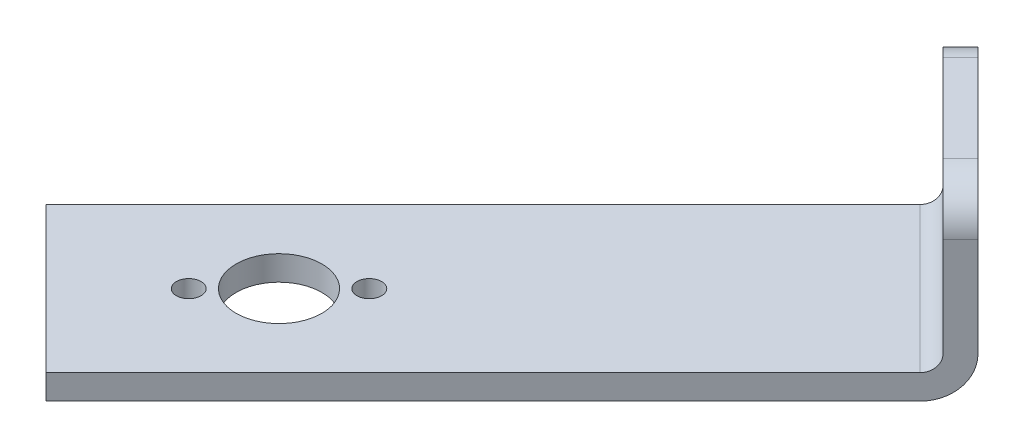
ISO-10303-21;
HEADER;
FILE_DESCRIPTION(('STEP AP214'),'2;1');
FILE_NAME('part.step','',(''),(''),'','','');
FILE_SCHEMA(('AUTOMOTIVE_DESIGN { 1 0 10303 214 1 1 1 1 }'));
ENDSEC;
DATA;
#1=APPLICATION_CONTEXT('core data for automotive mechanical design processes');
#2=APPLICATION_PROTOCOL_DEFINITION('international standard','automotive_design',2000,#1);
#3=PRODUCT_CONTEXT('',#1,'mechanical');
#4=PRODUCT('Part','Part','',(#3));
#5=PRODUCT_RELATED_PRODUCT_CATEGORY('part','',(#4));
#6=PRODUCT_DEFINITION_FORMATION('','',#4);
#7=PRODUCT_DEFINITION_CONTEXT('part definition',#1,'design');
#8=PRODUCT_DEFINITION('design','',#6,#7);
#9=PRODUCT_DEFINITION_SHAPE('','',#8);
#10=(LENGTH_UNIT() NAMED_UNIT(*) SI_UNIT(.MILLI.,.METRE.));
#11=(NAMED_UNIT(*) PLANE_ANGLE_UNIT() SI_UNIT($,.RADIAN.));
#12=(NAMED_UNIT(*) SI_UNIT($,.STERADIAN.) SOLID_ANGLE_UNIT());
#13=UNCERTAINTY_MEASURE_WITH_UNIT(LENGTH_MEASURE(1.E-05),#10,'distance_accuracy_value','');
#14=(GEOMETRIC_REPRESENTATION_CONTEXT(3) GLOBAL_UNCERTAINTY_ASSIGNED_CONTEXT((#13)) GLOBAL_UNIT_ASSIGNED_CONTEXT((#10,
#11,#12)) REPRESENTATION_CONTEXT('',''));
#15=CARTESIAN_POINT('',(0.,0.,0.));
#16=DIRECTION('',(0.,0.,1.));
#17=DIRECTION('',(1.,0.,0.));
#18=AXIS2_PLACEMENT_3D('',#15,#16,#17);
#19=CARTESIAN_POINT('',(42.4264068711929,-2.0931839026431E-13,-42.4264068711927));
#20=DIRECTION('',(-0.707106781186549,0.,0.707106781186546));
#21=DIRECTION('',(0.707106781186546,0.,0.707106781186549));
#22=AXIS2_PLACEMENT_3D('',#19,#20,#21);
#23=PLANE('',#22);
#24=CARTESIAN_POINT('',(47.729707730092,25.,-37.1231060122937));
#25=DIRECTION('',(-0.707106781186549,0.,0.707106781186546));
#26=DIRECTION('',(0.707106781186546,0.,0.707106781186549));
#27=AXIS2_PLACEMENT_3D('',#24,#25,#26);
#28=CIRCLE('',#27,5.);
#29=CARTESIAN_POINT('',(51.2652416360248,25.,-33.5875721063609));
#30=VERTEX_POINT('',#29);
#31=CARTESIAN_POINT('',(47.7297077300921,30.,-37.1231060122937));
#32=VERTEX_POINT('',#31);
#33=EDGE_CURVE('E93',#30,#32,#28,.T.);
#34=ORIENTED_EDGE('',*,*,#33,.F.);
#35=DIRECTION('',(0.,1.,0.));
#36=VECTOR('',#35,1.);
#37=CARTESIAN_POINT('',(51.2652416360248,11.,-33.5875721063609));
#38=LINE('',#37,#36);
#39=CARTESIAN_POINT('',(51.2652416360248,13.,-33.5875721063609));
#40=VERTEX_POINT('',#39);
#41=EDGE_CURVE('E97',#30,#40,#38,.F.);
#42=ORIENTED_EDGE('',*,*,#41,.T.);
#43=DIRECTION('',(-0.707106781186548,0.,-0.707106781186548));
#44=VECTOR('',#43,1.);
#45=CARTESIAN_POINT('',(33.5875721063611,13.,-51.2652416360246));
#46=LINE('',#45,#44);
#47=CARTESIAN_POINT('',(33.5875721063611,13.,-51.2652416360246));
#48=VERTEX_POINT('',#47);
#49=EDGE_CURVE('E165',#48,#40,#46,.F.);
#50=ORIENTED_EDGE('',*,*,#49,.F.);
#51=DIRECTION('',(0.,1.,0.));
#52=VECTOR('',#51,1.);
#53=CARTESIAN_POINT('',(33.587572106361,30.,-51.2652416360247));
#54=LINE('',#53,#52);
#55=CARTESIAN_POINT('',(33.5875721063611,25.,-51.2652416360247));
#56=VERTEX_POINT('',#55);
#57=EDGE_CURVE('E113',#48,#56,#54,.T.);
#58=ORIENTED_EDGE('',*,*,#57,.T.);
#59=CARTESIAN_POINT('',(37.1231060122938,25.,-47.729707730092));
#60=DIRECTION('',(-0.707106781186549,0.,0.707106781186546));
#61=DIRECTION('',(0.707106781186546,0.,0.707106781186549));
#62=AXIS2_PLACEMENT_3D('',#59,#60,#61);
#63=CIRCLE('',#62,5.);
#64=CARTESIAN_POINT('',(37.1231060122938,30.,-47.729707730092));
#65=VERTEX_POINT('',#64);
#66=EDGE_CURVE('E121',#65,#56,#63,.T.);
#67=ORIENTED_EDGE('',*,*,#66,.F.);
#68=DIRECTION('',(0.707106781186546,0.,0.707106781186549));
#69=VECTOR('',#68,1.);
#70=CARTESIAN_POINT('',(37.1231060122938,30.,-47.729707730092));
#71=LINE('',#70,#69);
#72=EDGE_CURVE('E100',#65,#32,#71,.T.);
#73=ORIENTED_EDGE('',*,*,#72,.T.);
#74=EDGE_LOOP('',(#34,#42,#50,#58,#67,#73));
#75=FACE_BOUND('',#74,.T.);
#76=CARTESIAN_POINT('',(42.426406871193,24.,-42.4264068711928));
#77=DIRECTION('',(0.707106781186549,0.,-0.707106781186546));
#78=DIRECTION('',(-0.707106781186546,0.,-0.707106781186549));
#79=AXIS2_PLACEMENT_3D('',#76,#77,#78);
#80=CIRCLE('',#79,3.5);
#81=CARTESIAN_POINT('',(39.9515331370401,24.,-44.9012806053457));
#82=VERTEX_POINT('',#81);
#83=EDGE_CURVE('E20',#82,#82,#80,.F.);
#84=ORIENTED_EDGE('',*,*,#83,.T.);
#85=EDGE_LOOP('',(#84));
#86=FACE_BOUND('',#85,.T.);
#87=ADVANCED_FACE('F17',(#75,#86),#23,.F.);
#88=CARTESIAN_POINT('',(36.7695526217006,24.0000000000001,-36.7695526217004));
#89=DIRECTION('',(0.707106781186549,0.,-0.707106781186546));
#90=DIRECTION('',(-0.707106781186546,0.,-0.707106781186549));
#91=AXIS2_PLACEMENT_3D('',#88,#89,#90);
#92=CYLINDRICAL_SURFACE('',#91,3.5);
#93=CARTESIAN_POINT('',(40.3050865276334,24.,-40.3050865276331));
#94=DIRECTION('',(0.707106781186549,0.,-0.707106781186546));
#95=DIRECTION('',(-0.707106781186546,0.,-0.707106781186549));
#96=AXIS2_PLACEMENT_3D('',#93,#94,#95);
#97=CIRCLE('',#96,3.5);
#98=CARTESIAN_POINT('',(37.8302127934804,24.,-42.779960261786));
#99=VERTEX_POINT('',#98);
#100=EDGE_CURVE('E162',#99,#99,#97,.T.);
#101=ORIENTED_EDGE('',*,*,#100,.F.);
#102=EDGE_LOOP('',(#101));
#103=FACE_BOUND('',#102,.T.);
#104=ORIENTED_EDGE('',*,*,#83,.F.);
#105=EDGE_LOOP('',(#104));
#106=FACE_BOUND('',#105,.T.);
#107=ADVANCED_FACE('F283',(#103,#106),#92,.F.);
#108=CARTESIAN_POINT('',(47.729707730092,25.,-37.1231060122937));
#109=DIRECTION('',(-0.707106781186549,0.,0.707106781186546));
#110=DIRECTION('',(0.707106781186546,0.,0.707106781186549));
#111=AXIS2_PLACEMENT_3D('',#108,#109,#110);
#112=CYLINDRICAL_SURFACE('',#111,5.);
#113=CARTESIAN_POINT('',(45.6083873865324,25.,-35.0017856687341));
#114=DIRECTION('',(-0.707106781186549,0.,0.707106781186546));
#115=DIRECTION('',(0.707106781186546,0.,0.707106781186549));
#116=AXIS2_PLACEMENT_3D('',#113,#114,#115);
#117=CIRCLE('',#116,5.);
#118=CARTESIAN_POINT('',(49.1439212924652,25.,-31.4662517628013));
#119=VERTEX_POINT('',#118);
#120=CARTESIAN_POINT('',(45.6083873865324,30.,-35.0017856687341));
#121=VERTEX_POINT('',#120);
#122=EDGE_CURVE('E117',#119,#121,#117,.T.);
#123=ORIENTED_EDGE('',*,*,#122,.F.);
#124=DIRECTION('',(-0.707106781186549,0.,0.707106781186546));
#125=VECTOR('',#124,1.);
#126=CARTESIAN_POINT('',(51.2652416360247,25.,-33.5875721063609));
#127=LINE('',#126,#125);
#128=EDGE_CURVE('E108',#119,#30,#127,.F.);
#129=ORIENTED_EDGE('',*,*,#128,.T.);
#130=ORIENTED_EDGE('',*,*,#33,.T.);
#131=DIRECTION('',(-0.707106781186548,0.,0.707106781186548));
#132=VECTOR('',#131,1.);
#133=CARTESIAN_POINT('',(47.7297077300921,30.,-37.1231060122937));
#134=LINE('',#133,#132);
#135=EDGE_CURVE('E125',#32,#121,#134,.T.);
#136=ORIENTED_EDGE('',*,*,#135,.T.);
#137=EDGE_LOOP('',(#123,#129,#130,#136));
#138=FACE_BOUND('',#137,.T.);
#139=ADVANCED_FACE('F116',(#138),#112,.T.);
#140=CARTESIAN_POINT('',(51.2652416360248,30.,-33.587572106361));
#141=DIRECTION('',(0.,-1.,0.));
#142=DIRECTION('',(1.,0.,0.));
#143=AXIS2_PLACEMENT_3D('',#140,#141,#142);
#144=PLANE('',#143);
#145=ORIENTED_EDGE('',*,*,#135,.F.);
#146=ORIENTED_EDGE('',*,*,#72,.F.);
#147=DIRECTION('',(-0.707106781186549,0.,0.707106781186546));
#148=VECTOR('',#147,1.);
#149=CARTESIAN_POINT('',(37.1231060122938,30.,-47.729707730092));
#150=LINE('',#149,#148);
#151=CARTESIAN_POINT('',(35.0017856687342,30.,-45.6083873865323));
#152=VERTEX_POINT('',#151);
#153=EDGE_CURVE('E118',#152,#65,#150,.F.);
#154=ORIENTED_EDGE('',*,*,#153,.F.);
#155=DIRECTION('',(0.707106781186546,0.,0.707106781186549));
#156=VECTOR('',#155,1.);
#157=CARTESIAN_POINT('',(40.3050865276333,30.,-40.3050865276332));
#158=LINE('',#157,#156);
#159=EDGE_CURVE('E159',#121,#152,#158,.F.);
#160=ORIENTED_EDGE('',*,*,#159,.F.);
#161=EDGE_LOOP('',(#145,#146,#154,#160));
#162=FACE_BOUND('',#161,.T.);
#163=ADVANCED_FACE('F172',(#162),#144,.F.);
#164=CARTESIAN_POINT('',(37.1231060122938,25.,-47.729707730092));
#165=DIRECTION('',(-0.707106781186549,0.,0.707106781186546));
#166=DIRECTION('',(0.707106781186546,0.,0.707106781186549));
#167=AXIS2_PLACEMENT_3D('',#164,#165,#166);
#168=CYLINDRICAL_SURFACE('',#167,5.);
#169=CARTESIAN_POINT('',(35.0017856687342,25.,-45.6083873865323));
#170=DIRECTION('',(-0.707106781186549,0.,0.707106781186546));
#171=DIRECTION('',(0.707106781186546,0.,0.707106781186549));
#172=AXIS2_PLACEMENT_3D('',#169,#170,#171);
#173=CIRCLE('',#172,5.);
#174=CARTESIAN_POINT('',(31.4662517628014,25.,-49.1439212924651));
#175=VERTEX_POINT('',#174);
#176=EDGE_CURVE('E157',#152,#175,#173,.T.);
#177=ORIENTED_EDGE('',*,*,#176,.F.);
#178=ORIENTED_EDGE('',*,*,#153,.T.);
#179=ORIENTED_EDGE('',*,*,#66,.T.);
#180=DIRECTION('',(0.707106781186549,0.,-0.707106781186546));
#181=VECTOR('',#180,1.);
#182=CARTESIAN_POINT('',(33.5875721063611,25.,-51.2652416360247));
#183=LINE('',#182,#181);
#184=EDGE_CURVE('E182',#56,#175,#183,.F.);
#185=ORIENTED_EDGE('',*,*,#184,.T.);
#186=EDGE_LOOP('',(#177,#178,#179,#185));
#187=FACE_BOUND('',#186,.T.);
#188=ADVANCED_FACE('F185',(#187),#168,.T.);
#189=CARTESIAN_POINT('',(30.0520382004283,13.,-47.7297077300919));
#190=DIRECTION('',(-0.707106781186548,0.,-0.707106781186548));
#191=DIRECTION('',(-0.707106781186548,0.,0.707106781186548));
#192=AXIS2_PLACEMENT_3D('',#189,#190,#191);
#193=CYLINDRICAL_SURFACE('',#192,4.99999999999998);
#194=ORIENTED_EDGE('',*,*,#49,.T.);
#195=CARTESIAN_POINT('',(47.7297077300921,13.,-30.0520382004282));
#196=DIRECTION('',(-0.707106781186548,0.,-0.707106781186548));
#197=DIRECTION('',(-0.707106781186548,0.,0.707106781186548));
#198=AXIS2_PLACEMENT_3D('',#195,#196,#197);
#199=CIRCLE('',#198,4.99999999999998);
#200=CARTESIAN_POINT('',(47.7297077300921,8.,-30.0520382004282));
#201=VERTEX_POINT('',#200);
#202=EDGE_CURVE('E112',#201,#40,#199,.F.);
#203=ORIENTED_EDGE('',*,*,#202,.F.);
#204=DIRECTION('',(0.707106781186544,0.,0.707106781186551));
#205=VECTOR('',#204,1.);
#206=CARTESIAN_POINT('',(30.0520382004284,8.,-47.729707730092));
#207=LINE('',#206,#205);
#208=CARTESIAN_POINT('',(30.0520382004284,8.00000000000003,-47.7297077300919));
#209=VERTEX_POINT('',#208);
#210=EDGE_CURVE('E151',#209,#201,#207,.T.);
#211=ORIENTED_EDGE('',*,*,#210,.F.);
#212=CARTESIAN_POINT('',(30.0520382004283,13.,-47.7297077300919));
#213=DIRECTION('',(-0.707106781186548,0.,-0.707106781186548));
#214=DIRECTION('',(-0.707106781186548,0.,0.707106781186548));
#215=AXIS2_PLACEMENT_3D('',#212,#213,#214);
#216=CIRCLE('',#215,4.99999999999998);
#217=EDGE_CURVE('E152',#209,#48,#216,.F.);
#218=ORIENTED_EDGE('',*,*,#217,.T.);
#219=EDGE_LOOP('',(#194,#203,#211,#218));
#220=FACE_BOUND('',#219,.T.);
#221=ADVANCED_FACE('F274',(#220),#193,.T.);
#222=CARTESIAN_POINT('',(40.3050865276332,-1.9884394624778E-13,-40.3050865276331));
#223=DIRECTION('',(-0.707106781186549,0.,0.707106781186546));
#224=DIRECTION('',(0.707106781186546,0.,0.707106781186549));
#225=AXIS2_PLACEMENT_3D('',#222,#223,#224);
#226=PLANE('',#225);
#227=DIRECTION('',(0.,1.,0.));
#228=VECTOR('',#227,1.);
#229=CARTESIAN_POINT('',(31.4662517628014,-1.9884394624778E-13,-49.143921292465));
#230=LINE('',#229,#228);
#231=CARTESIAN_POINT('',(31.4662517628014,13.,-49.143921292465));
#232=VERTEX_POINT('',#231);
#233=EDGE_CURVE('E156',#175,#232,#230,.F.);
#234=ORIENTED_EDGE('',*,*,#233,.T.);
#235=DIRECTION('',(-0.707106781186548,0.,-0.707106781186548));
#236=VECTOR('',#235,1.);
#237=CARTESIAN_POINT('',(31.4662517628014,13.,-49.143921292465));
#238=LINE('',#237,#236);
#239=CARTESIAN_POINT('',(49.1439212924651,13.,-31.4662517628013));
#240=VERTEX_POINT('',#239);
#241=EDGE_CURVE('E147',#232,#240,#238,.F.);
#242=ORIENTED_EDGE('',*,*,#241,.T.);
#243=DIRECTION('',(0.,1.,0.));
#244=VECTOR('',#243,1.);
#245=CARTESIAN_POINT('',(49.1439212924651,-1.9884394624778E-13,-31.4662517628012));
#246=LINE('',#245,#244);
#247=EDGE_CURVE('E161',#240,#119,#246,.T.);
#248=ORIENTED_EDGE('',*,*,#247,.T.);
#249=ORIENTED_EDGE('',*,*,#122,.T.);
#250=ORIENTED_EDGE('',*,*,#159,.T.);
#251=ORIENTED_EDGE('',*,*,#176,.T.);
#252=EDGE_LOOP('',(#234,#242,#248,#249,#250,#251));
#253=FACE_BOUND('',#252,.T.);
#254=ORIENTED_EDGE('',*,*,#100,.T.);
#255=EDGE_LOOP('',(#254));
#256=FACE_BOUND('',#255,.T.);
#257=ADVANCED_FACE('F189',(#253,#256),#226,.T.);
#258=CARTESIAN_POINT('',(0.,8.,0.));
#259=DIRECTION('',(0.,-1.,0.));
#260=DIRECTION('',(0.,0.,-1.));
#261=AXIS2_PLACEMENT_3D('',#258,#259,#260);
#262=PLANE('',#261);
#263=CARTESIAN_POINT('',(-5.48007755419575,8.,5.48007755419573));
#264=DIRECTION('',(0.,1.,0.));
#265=DIRECTION('',(0.,0.,1.));
#266=AXIS2_PLACEMENT_3D('',#263,#264,#265);
#267=CIRCLE('',#266,1.5);
#268=CARTESIAN_POINT('',(-5.48007755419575,8.,6.98007755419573));
#269=VERTEX_POINT('',#268);
#270=EDGE_CURVE('E133',#269,#269,#267,.T.);
#271=ORIENTED_EDGE('',*,*,#270,.T.);
#272=EDGE_LOOP('',(#271));
#273=FACE_BOUND('',#272,.T.);
#274=CARTESIAN_POINT('',(5.48007755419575,8.,-5.48007755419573));
#275=DIRECTION('',(0.,1.,0.));
#276=DIRECTION('',(0.,0.,1.));
#277=AXIS2_PLACEMENT_3D('',#274,#275,#276);
#278=CIRCLE('',#277,1.5);
#279=CARTESIAN_POINT('',(5.48007755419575,8.,-3.98007755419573));
#280=VERTEX_POINT('',#279);
#281=EDGE_CURVE('E140',#280,#280,#278,.T.);
#282=ORIENTED_EDGE('',*,*,#281,.T.);
#283=EDGE_LOOP('',(#282));
#284=FACE_BOUND('',#283,.T.);
#285=DIRECTION('',(-0.707106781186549,0.,0.707106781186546));
#286=VECTOR('',#285,1.);
#287=CARTESIAN_POINT('',(-5.30330085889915,8.,22.9809703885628));
#288=LINE('',#287,#286);
#289=CARTESIAN_POINT('',(-5.30330085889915,8.,22.9809703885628));
#290=VERTEX_POINT('',#289);
#291=EDGE_CURVE('E146',#201,#290,#288,.T.);
#292=ORIENTED_EDGE('',*,*,#291,.T.);
#293=DIRECTION('',(-0.707106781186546,0.,-0.707106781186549));
#294=VECTOR('',#293,1.);
#295=CARTESIAN_POINT('',(-22.9809703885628,8.,5.30330085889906));
#296=LINE('',#295,#294);
#297=CARTESIAN_POINT('',(-22.9809703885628,8.,5.30330085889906));
#298=VERTEX_POINT('',#297);
#299=EDGE_CURVE('E210',#290,#298,#296,.T.);
#300=ORIENTED_EDGE('',*,*,#299,.T.);
#301=DIRECTION('',(0.707106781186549,0.,-0.707106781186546));
#302=VECTOR('',#301,1.);
#303=CARTESIAN_POINT('',(-22.9809703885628,8.,5.30330085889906));
#304=LINE('',#303,#302);
#305=EDGE_CURVE('E143',#298,#209,#304,.T.);
#306=ORIENTED_EDGE('',*,*,#305,.T.);
#307=ORIENTED_EDGE('',*,*,#210,.T.);
#308=EDGE_LOOP('',(#292,#300,#306,#307));
#309=FACE_BOUND('',#308,.T.);
#310=CARTESIAN_POINT('',(0.,8.,0.));
#311=DIRECTION('',(0.,1.,0.));
#312=DIRECTION('',(0.,0.,1.));
#313=AXIS2_PLACEMENT_3D('',#310,#311,#312);
#314=CIRCLE('',#313,5.2);
#315=CARTESIAN_POINT('',(0.,8.,5.2));
#316=VERTEX_POINT('',#315);
#317=EDGE_CURVE('E137',#316,#316,#314,.T.);
#318=ORIENTED_EDGE('',*,*,#317,.T.);
#319=EDGE_LOOP('',(#318));
#320=FACE_BOUND('',#319,.T.);
#321=ADVANCED_FACE('F230',(#273,#284,#309,#320),#262,.T.);
#322=CARTESIAN_POINT('',(30.0520382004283,13.,-47.7297077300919));
#323=DIRECTION('',(-0.707106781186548,0.,-0.707106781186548));
#324=DIRECTION('',(-0.707106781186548,0.,0.707106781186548));
#325=AXIS2_PLACEMENT_3D('',#322,#323,#324);
#326=CYLINDRICAL_SURFACE('',#325,1.99999999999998);
#327=CARTESIAN_POINT('',(47.7297077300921,13.,-30.0520382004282));
#328=DIRECTION('',(-0.707106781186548,0.,-0.707106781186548));
#329=DIRECTION('',(-0.707106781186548,0.,0.707106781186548));
#330=AXIS2_PLACEMENT_3D('',#327,#328,#329);
#331=CIRCLE('',#330,1.99999999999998);
#332=CARTESIAN_POINT('',(47.7297077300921,11.,-30.0520382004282));
#333=VERTEX_POINT('',#332);
#334=EDGE_CURVE('E144',#240,#333,#331,.T.);
#335=ORIENTED_EDGE('',*,*,#334,.F.);
#336=ORIENTED_EDGE('',*,*,#241,.F.);
#337=CARTESIAN_POINT('',(30.0520382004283,13.,-47.7297077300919));
#338=DIRECTION('',(-0.707106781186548,0.,-0.707106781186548));
#339=DIRECTION('',(-0.707106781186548,0.,0.707106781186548));
#340=AXIS2_PLACEMENT_3D('',#337,#338,#339);
#341=CIRCLE('',#340,1.99999999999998);
#342=CARTESIAN_POINT('',(30.0520382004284,11.,-47.7297077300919));
#343=VERTEX_POINT('',#342);
#344=EDGE_CURVE('E148',#343,#232,#341,.F.);
#345=ORIENTED_EDGE('',*,*,#344,.F.);
#346=DIRECTION('',(0.707106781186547,0.,0.707106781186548));
#347=VECTOR('',#346,1.);
#348=CARTESIAN_POINT('',(30.0520382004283,11.,-47.7297077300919));
#349=LINE('',#348,#347);
#350=EDGE_CURVE('E136',#343,#333,#349,.T.);
#351=ORIENTED_EDGE('',*,*,#350,.T.);
#352=EDGE_LOOP('',(#335,#336,#345,#351));
#353=FACE_BOUND('',#352,.T.);
#354=ADVANCED_FACE('F193',(#353),#326,.F.);
#355=CARTESIAN_POINT('',(-5.30330085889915,8.,22.9809703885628));
#356=DIRECTION('',(-0.707106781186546,0.,-0.707106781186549));
#357=DIRECTION('',(-0.707106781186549,0.,0.707106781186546));
#358=AXIS2_PLACEMENT_3D('',#355,#356,#357);
#359=PLANE('',#358);
#360=DIRECTION('',(0.,1.,0.));
#361=VECTOR('',#360,1.);
#362=CARTESIAN_POINT('',(-5.30330085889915,8.,22.9809703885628));
#363=LINE('',#362,#361);
#364=CARTESIAN_POINT('',(-5.30330085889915,11.,22.9809703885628));
#365=VERTEX_POINT('',#364);
#366=EDGE_CURVE('E206',#365,#290,#363,.F.);
#367=ORIENTED_EDGE('',*,*,#366,.T.);
#368=ORIENTED_EDGE('',*,*,#291,.F.);
#369=ORIENTED_EDGE('',*,*,#202,.T.);
#370=ORIENTED_EDGE('',*,*,#41,.F.);
#371=ORIENTED_EDGE('',*,*,#128,.F.);
#372=ORIENTED_EDGE('',*,*,#247,.F.);
#373=ORIENTED_EDGE('',*,*,#334,.T.);
#374=DIRECTION('',(-0.707106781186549,0.,0.707106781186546));
#375=VECTOR('',#374,1.);
#376=CARTESIAN_POINT('',(47.7297077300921,11.,-30.0520382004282));
#377=LINE('',#376,#375);
#378=EDGE_CURVE('E199',#333,#365,#377,.T.);
#379=ORIENTED_EDGE('',*,*,#378,.T.);
#380=EDGE_LOOP('',(#367,#368,#369,#370,#371,#372,#373,#379));
#381=FACE_BOUND('',#380,.T.);
#382=ADVANCED_FACE('F107',(#381),#359,.F.);
#383=CARTESIAN_POINT('',(-22.9809703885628,8.,5.30330085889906));
#384=DIRECTION('',(0.707106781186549,0.,-0.707106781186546));
#385=DIRECTION('',(-0.707106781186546,0.,-0.707106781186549));
#386=AXIS2_PLACEMENT_3D('',#383,#384,#385);
#387=PLANE('',#386);
#388=DIRECTION('',(0.,1.,0.));
#389=VECTOR('',#388,1.);
#390=CARTESIAN_POINT('',(-22.9809703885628,8.,5.30330085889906));
#391=LINE('',#390,#389);
#392=CARTESIAN_POINT('',(-22.9809703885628,11.,5.30330085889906));
#393=VERTEX_POINT('',#392);
#394=EDGE_CURVE('E35',#393,#298,#391,.F.);
#395=ORIENTED_EDGE('',*,*,#394,.T.);
#396=ORIENTED_EDGE('',*,*,#299,.F.);
#397=ORIENTED_EDGE('',*,*,#366,.F.);
#398=DIRECTION('',(-0.707106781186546,0.,-0.707106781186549));
#399=VECTOR('',#398,1.);
#400=CARTESIAN_POINT('',(-5.30330085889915,11.,22.9809703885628));
#401=LINE('',#400,#399);
#402=EDGE_CURVE('E202',#365,#393,#401,.T.);
#403=ORIENTED_EDGE('',*,*,#402,.T.);
#404=EDGE_LOOP('',(#395,#396,#397,#403));
#405=FACE_BOUND('',#404,.T.);
#406=ADVANCED_FACE('F235',(#405),#387,.F.);
#407=CARTESIAN_POINT('',(-22.9809703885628,8.,5.30330085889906));
#408=DIRECTION('',(0.707106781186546,0.,0.707106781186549));
#409=DIRECTION('',(0.707106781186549,0.,-0.707106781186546));
#410=AXIS2_PLACEMENT_3D('',#407,#408,#409);
#411=PLANE('',#410);
#412=DIRECTION('',(0.707106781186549,0.,-0.707106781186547));
#413=VECTOR('',#412,1.);
#414=CARTESIAN_POINT('',(-22.9809703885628,11.,5.30330085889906));
#415=LINE('',#414,#413);
#416=EDGE_CURVE('E132',#393,#343,#415,.T.);
#417=ORIENTED_EDGE('',*,*,#416,.T.);
#418=ORIENTED_EDGE('',*,*,#344,.T.);
#419=ORIENTED_EDGE('',*,*,#233,.F.);
#420=ORIENTED_EDGE('',*,*,#184,.F.);
#421=ORIENTED_EDGE('',*,*,#57,.F.);
#422=ORIENTED_EDGE('',*,*,#217,.F.);
#423=ORIENTED_EDGE('',*,*,#305,.F.);
#424=ORIENTED_EDGE('',*,*,#394,.F.);
#425=EDGE_LOOP('',(#417,#418,#419,#420,#421,#422,#423,#424));
#426=FACE_BOUND('',#425,.T.);
#427=ADVANCED_FACE('F186',(#426),#411,.F.);
#428=CARTESIAN_POINT('',(5.48007755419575,8.,-5.48007755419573));
#429=DIRECTION('',(0.,1.,0.));
#430=DIRECTION('',(0.,0.,1.));
#431=AXIS2_PLACEMENT_3D('',#428,#429,#430);
#432=CYLINDRICAL_SURFACE('',#431,1.5);
#433=CARTESIAN_POINT('',(5.48007755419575,11.,-5.48007755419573));
#434=DIRECTION('',(0.,1.,0.));
#435=DIRECTION('',(0.,0.,1.));
#436=AXIS2_PLACEMENT_3D('',#433,#434,#435);
#437=CIRCLE('',#436,1.5);
#438=CARTESIAN_POINT('',(5.48007755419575,11.,-3.98007755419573));
#439=VERTEX_POINT('',#438);
#440=EDGE_CURVE('E129',#439,#439,#437,.T.);
#441=ORIENTED_EDGE('',*,*,#440,.T.);
#442=EDGE_LOOP('',(#441));
#443=FACE_BOUND('',#442,.T.);
#444=ORIENTED_EDGE('',*,*,#281,.F.);
#445=EDGE_LOOP('',(#444));
#446=FACE_BOUND('',#445,.T.);
#447=ADVANCED_FACE('F256',(#443,#446),#432,.F.);
#448=CARTESIAN_POINT('',(0.,8.,0.));
#449=DIRECTION('',(0.,1.,0.));
#450=DIRECTION('',(0.,0.,1.));
#451=AXIS2_PLACEMENT_3D('',#448,#449,#450);
#452=CYLINDRICAL_SURFACE('',#451,5.2);
#453=CARTESIAN_POINT('',(0.,11.,0.));
#454=DIRECTION('',(0.,1.,0.));
#455=DIRECTION('',(0.,0.,1.));
#456=AXIS2_PLACEMENT_3D('',#453,#454,#455);
#457=CIRCLE('',#456,5.2);
#458=CARTESIAN_POINT('',(0.,11.,5.2));
#459=VERTEX_POINT('',#458);
#460=EDGE_CURVE('E26',#459,#459,#457,.T.);
#461=ORIENTED_EDGE('',*,*,#460,.T.);
#462=EDGE_LOOP('',(#461));
#463=FACE_BOUND('',#462,.T.);
#464=ORIENTED_EDGE('',*,*,#317,.F.);
#465=EDGE_LOOP('',(#464));
#466=FACE_BOUND('',#465,.T.);
#467=ADVANCED_FACE('F248',(#463,#466),#452,.F.);
#468=CARTESIAN_POINT('',(-5.48007755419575,8.,5.48007755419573));
#469=DIRECTION('',(0.,1.,0.));
#470=DIRECTION('',(0.,0.,1.));
#471=AXIS2_PLACEMENT_3D('',#468,#469,#470);
#472=CYLINDRICAL_SURFACE('',#471,1.5);
#473=CARTESIAN_POINT('',(-5.48007755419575,11.,5.48007755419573));
#474=DIRECTION('',(0.,1.,0.));
#475=DIRECTION('',(0.,0.,1.));
#476=AXIS2_PLACEMENT_3D('',#473,#474,#475);
#477=CIRCLE('',#476,1.5);
#478=CARTESIAN_POINT('',(-5.48007755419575,11.,6.98007755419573));
#479=VERTEX_POINT('',#478);
#480=EDGE_CURVE('E11',#479,#479,#477,.T.);
#481=ORIENTED_EDGE('',*,*,#480,.T.);
#482=EDGE_LOOP('',(#481));
#483=FACE_BOUND('',#482,.T.);
#484=ORIENTED_EDGE('',*,*,#270,.F.);
#485=EDGE_LOOP('',(#484));
#486=FACE_BOUND('',#485,.T.);
#487=ADVANCED_FACE('F241',(#483,#486),#472,.F.);
#488=CARTESIAN_POINT('',(0.,11.,0.));
#489=DIRECTION('',(0.,-1.,0.));
#490=DIRECTION('',(0.,0.,-1.));
#491=AXIS2_PLACEMENT_3D('',#488,#489,#490);
#492=PLANE('',#491);
#493=ORIENTED_EDGE('',*,*,#480,.F.);
#494=EDGE_LOOP('',(#493));
#495=FACE_BOUND('',#494,.T.);
#496=ORIENTED_EDGE('',*,*,#460,.F.);
#497=EDGE_LOOP('',(#496));
#498=FACE_BOUND('',#497,.T.);
#499=ORIENTED_EDGE('',*,*,#440,.F.);
#500=EDGE_LOOP('',(#499));
#501=FACE_BOUND('',#500,.T.);
#502=ORIENTED_EDGE('',*,*,#402,.F.);
#503=ORIENTED_EDGE('',*,*,#378,.F.);
#504=ORIENTED_EDGE('',*,*,#350,.F.);
#505=ORIENTED_EDGE('',*,*,#416,.F.);
#506=EDGE_LOOP('',(#502,#503,#504,#505));
#507=FACE_BOUND('',#506,.T.);
#508=ADVANCED_FACE('F239',(#495,#498,#501,#507),#492,.F.);
#509=CLOSED_SHELL('',(#87,#107,#139,#163,#188,#221,#257,#321,#354,#382,#406,#427,#447,#467,#487,#508));
#510=MANIFOLD_SOLID_BREP('B1',#509);
#511=ADVANCED_BREP_SHAPE_REPRESENTATION('',(#18,#510),#14);
#512=SHAPE_DEFINITION_REPRESENTATION(#9,#511);
ENDSEC;
END-ISO-10303-21;
